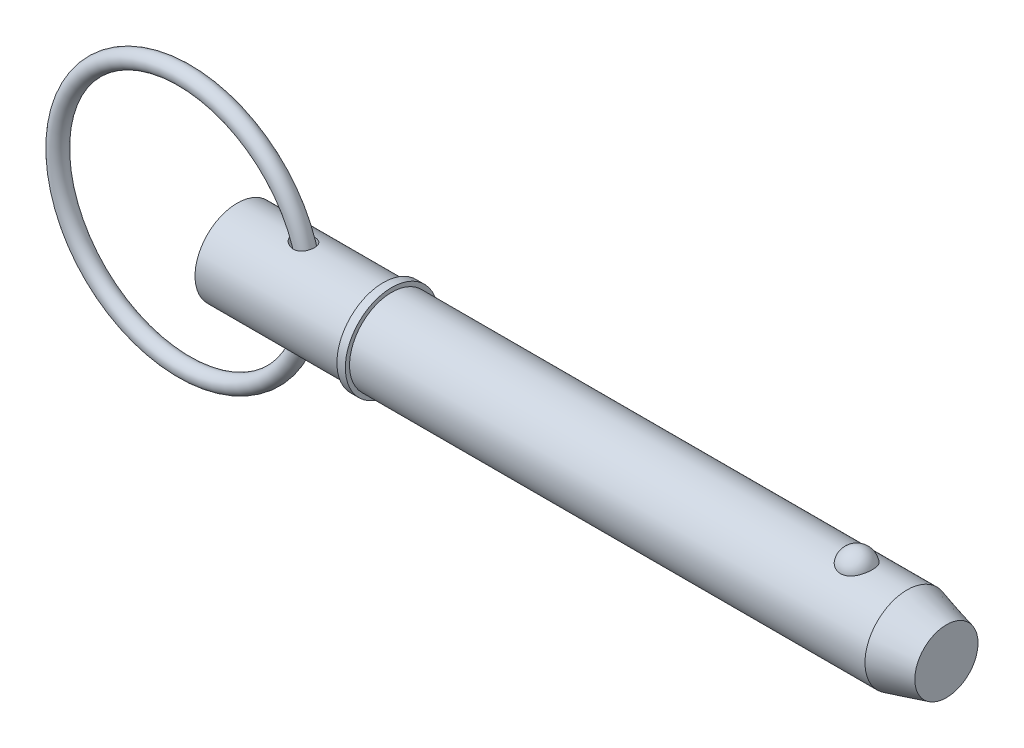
ISO-10303-21;
HEADER;
FILE_DESCRIPTION(('STEP AP214'),'2;1');
FILE_NAME('part.step','',(''),(''),'','','');
FILE_SCHEMA(('AUTOMOTIVE_DESIGN { 1 0 10303 214 1 1 1 1 }'));
ENDSEC;
DATA;
#1=APPLICATION_CONTEXT('core data for automotive mechanical design processes');
#2=APPLICATION_PROTOCOL_DEFINITION('international standard','automotive_design',2000,#1);
#3=PRODUCT_CONTEXT('',#1,'mechanical');
#4=PRODUCT('Part','Part','',(#3));
#5=PRODUCT_RELATED_PRODUCT_CATEGORY('part','',(#4));
#6=PRODUCT_DEFINITION_FORMATION('','',#4);
#7=PRODUCT_DEFINITION_CONTEXT('part definition',#1,'design');
#8=PRODUCT_DEFINITION('design','',#6,#7);
#9=PRODUCT_DEFINITION_SHAPE('','',#8);
#10=(LENGTH_UNIT() NAMED_UNIT(*) SI_UNIT(.MILLI.,.METRE.));
#11=(NAMED_UNIT(*) PLANE_ANGLE_UNIT() SI_UNIT($,.RADIAN.));
#12=(NAMED_UNIT(*) SI_UNIT($,.STERADIAN.) SOLID_ANGLE_UNIT());
#13=UNCERTAINTY_MEASURE_WITH_UNIT(LENGTH_MEASURE(1.E-05),#10,'distance_accuracy_value','');
#14=(GEOMETRIC_REPRESENTATION_CONTEXT(3) GLOBAL_UNCERTAINTY_ASSIGNED_CONTEXT((#13)) GLOBAL_UNIT_ASSIGNED_CONTEXT((#10,
#11,#12)) REPRESENTATION_CONTEXT('',''));
#15=CARTESIAN_POINT('',(0.,0.,0.));
#16=DIRECTION('',(0.,0.,1.));
#17=DIRECTION('',(1.,0.,0.));
#18=AXIS2_PLACEMENT_3D('',#15,#16,#17);
#19=CARTESIAN_POINT('',(-11.9894358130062,0.,0.));
#20=DIRECTION('',(0.,0.,1.));
#21=DIRECTION('',(1.,0.,0.));
#22=AXIS2_PLACEMENT_3D('',#19,#20,#21);
#23=TOROIDAL_SURFACE('',#22,28.575,1.905);
#24=CARTESIAN_POINT('',(18.4905641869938,0.,0.));
#25=VERTEX_POINT('',#24);
#26=VERTEX_LOOP('',#25);
#27=FACE_BOUND('',#26,.T.);
#28=ADVANCED_FACE('P0_F12',(#27),#23,.T.);
#29=CLOSED_SHELL('',(#28));
#30=MANIFOLD_SOLID_BREP('P0_B1',#29);
#31=CARTESIAN_POINT('',(0.,0.,0.));
#32=DIRECTION('',(1.,0.,0.));
#33=DIRECTION('',(0.,0.,-1.));
#34=AXIS2_PLACEMENT_3D('',#31,#32,#33);
#35=CYLINDRICAL_SURFACE('',#34,9.525);
#36=CARTESIAN_POINT('',(12.9513882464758,9.41921920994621,-1.41559473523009));
#37=CARTESIAN_POINT('',(13.0504692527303,9.40163924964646,-1.53256769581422));
#38=CARTESIAN_POINT('',(13.1602600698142,9.38319823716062,-1.64044593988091));
#39=CARTESIAN_POINT('',(13.3966485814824,9.34687220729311,-1.83618480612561));
#40=CARTESIAN_POINT('',(13.5232761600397,9.32898824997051,-1.92400906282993));
#41=CARTESIAN_POINT('',(13.78900694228,9.29593183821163,-2.07784697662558));
#42=CARTESIAN_POINT('',(13.9280753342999,9.28075215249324,-2.14391921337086));
#43=CARTESIAN_POINT('',(14.2153444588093,9.25488828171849,-2.25295850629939));
#44=CARTESIAN_POINT('',(14.3635415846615,9.24420233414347,-2.295934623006));
#45=CARTESIAN_POINT('',(14.669669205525,9.22859713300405,-2.3579005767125));
#46=CARTESIAN_POINT('',(14.8277567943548,9.22385123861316,-2.37617053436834));
#47=CARTESIAN_POINT('',(15.1447573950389,9.22170813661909,-2.38448481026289));
#48=CARTESIAN_POINT('',(15.3036699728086,9.22430739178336,-2.3745427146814));
#49=CARTESIAN_POINT('',(15.6046561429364,9.2363636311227,-2.32717331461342));
#50=CARTESIAN_POINT('',(15.7470893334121,9.24528216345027,-2.29190131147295));
#51=CARTESIAN_POINT('',(16.0228763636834,9.26842607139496,-2.19642882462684));
#52=CARTESIAN_POINT('',(16.1562346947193,9.28264879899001,-2.1362407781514));
#53=CARTESIAN_POINT('',(16.3991522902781,9.31332263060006,-1.99805318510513));
#54=CARTESIAN_POINT('',(16.5097585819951,9.32951023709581,-1.92182839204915));
#55=CARTESIAN_POINT('',(16.7159974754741,9.36298467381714,-1.75147176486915));
#56=CARTESIAN_POINT('',(16.811631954,9.38027136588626,-1.65734217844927));
#57=CARTESIAN_POINT('',(16.9833240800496,9.41356881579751,-1.45618916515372));
#58=CARTESIAN_POINT('',(17.0597719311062,9.42959946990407,-1.34950141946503));
#59=CARTESIAN_POINT('',(17.1939538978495,9.45905380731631,-1.1246201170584));
#60=CARTESIAN_POINT('',(17.2516877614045,9.4724774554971,-1.00642640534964));
#61=CARTESIAN_POINT('',(17.3474400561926,9.49535683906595,-0.760990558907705));
#62=CARTESIAN_POINT('',(17.3853184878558,9.50478431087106,-0.633691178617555));
#63=CARTESIAN_POINT('',(17.4399027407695,9.51852575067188,-0.374363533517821));
#64=CARTESIAN_POINT('',(17.4566077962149,9.52283953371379,-0.242335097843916));
#65=CARTESIAN_POINT('',(17.4685150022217,9.52590431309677,0.0235692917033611));
#66=CARTESIAN_POINT('',(17.4635842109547,9.52462091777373,0.157451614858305));
#67=CARTESIAN_POINT('',(17.4320243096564,9.5165501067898,0.422467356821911));
#68=CARTESIAN_POINT('',(17.4053947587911,9.50976257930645,0.553600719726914));
#69=CARTESIAN_POINT('',(17.3310009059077,9.49140797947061,0.809490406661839));
#70=CARTESIAN_POINT('',(17.2832204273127,9.47983724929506,0.93424176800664));
#71=CARTESIAN_POINT('',(17.1676219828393,9.45318034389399,1.1736825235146));
#72=CARTESIAN_POINT('',(17.0998044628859,9.43809424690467,1.28837214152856));
#73=CARTESIAN_POINT('',(16.9461013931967,9.40614962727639,1.50393386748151));
#74=CARTESIAN_POINT('',(16.8602910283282,9.38929862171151,1.6048606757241));
#75=CARTESIAN_POINT('',(16.6726759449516,9.35566510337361,1.79055313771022));
#76=CARTESIAN_POINT('',(16.5708731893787,9.33888258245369,1.87532077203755));
#77=CARTESIAN_POINT('',(16.3550631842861,9.30741331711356,2.02572386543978));
#78=CARTESIAN_POINT('',(16.2411701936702,9.29270956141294,2.09151983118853));
#79=CARTESIAN_POINT('',(16.0037488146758,9.26681293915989,2.20343355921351));
#80=CARTESIAN_POINT('',(15.8802207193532,9.25561996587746,2.24955191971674));
#81=CARTESIAN_POINT('',(15.6262451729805,9.23779438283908,2.32167613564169));
#82=CARTESIAN_POINT('',(15.4957570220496,9.23119272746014,2.34754561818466));
#83=CARTESIAN_POINT('',(15.2322153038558,9.22318493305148,2.37881082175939));
#84=CARTESIAN_POINT('',(15.0991611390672,9.22178001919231,2.3842017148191));
#85=CARTESIAN_POINT('',(14.8267609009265,9.22414647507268,2.37503099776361));
#86=CARTESIAN_POINT('',(14.6874545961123,9.22819578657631,2.35939810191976));
#87=CARTESIAN_POINT('',(14.412976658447,9.24129253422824,2.30756034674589));
#88=CARTESIAN_POINT('',(14.2778066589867,9.25034191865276,2.27134746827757));
#89=CARTESIAN_POINT('',(14.0027915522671,9.27334688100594,2.17561454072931));
#90=CARTESIAN_POINT('',(13.8635960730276,9.28766658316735,2.11431132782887));
#91=CARTESIAN_POINT('',(13.5969045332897,9.31925368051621,1.97041856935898));
#92=CARTESIAN_POINT('',(13.4694182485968,9.33652350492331,1.88781145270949));
#93=CARTESIAN_POINT('',(13.2243568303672,9.37286659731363,1.69844580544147));
#94=CARTESIAN_POINT('',(13.1075060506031,9.39198626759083,1.5907521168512));
#95=CARTESIAN_POINT('',(12.8957171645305,9.42881110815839,1.35544651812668));
#96=CARTESIAN_POINT('',(12.8007455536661,9.44651841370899,1.22786557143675));
#97=CARTESIAN_POINT('',(12.6580495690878,9.4741137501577,0.98872437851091));
#98=CARTESIAN_POINT('',(12.604453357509,9.4848570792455,0.880756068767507));
#99=CARTESIAN_POINT('',(12.515693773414,9.50295777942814,0.657225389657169));
#100=CARTESIAN_POINT('',(12.4805142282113,9.51031812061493,0.54166978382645));
#101=CARTESIAN_POINT('',(12.4305797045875,9.52083647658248,0.305475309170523));
#102=CARTESIAN_POINT('',(12.4159122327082,9.52397648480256,0.184816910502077));
#103=CARTESIAN_POINT('',(12.408320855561,9.52559626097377,-0.0572308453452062));
#104=CARTESIAN_POINT('',(12.4153963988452,9.52407614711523,-0.178620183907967));
#105=CARTESIAN_POINT('',(12.4495068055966,9.51684301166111,-0.409566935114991));
#106=CARTESIAN_POINT('',(12.4750931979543,9.51143444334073,-0.519353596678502));
#107=CARTESIAN_POINT('',(12.543120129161,9.49733710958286,-0.733285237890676));
#108=CARTESIAN_POINT('',(12.5855568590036,9.4886490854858,-0.837431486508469));
#109=CARTESIAN_POINT('',(12.6780792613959,9.47023833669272,-1.02356028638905));
#110=CARTESIAN_POINT('',(12.7261842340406,9.46084463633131,-1.10657511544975));
#111=CARTESIAN_POINT('',(12.8319313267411,9.44081892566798,-1.26610577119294));
#112=CARTESIAN_POINT('',(12.8895756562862,9.43018662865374,-1.34262008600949));
#113=CARTESIAN_POINT('',(12.9513882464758,9.41921920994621,-1.41559473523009));
#114=B_SPLINE_CURVE_WITH_KNOTS('',3,(#36,#37,#38,#39,#40,#41,#42,#43,#44,#45,#46,#47,#48,#49,
#50,#51,#52,#53,#54,#55,#56,#57,#58,#59,#60,#61,#62,#63,#64,#65,#66,#67,#68,#69,#70,#71,#72,#73,
#74,#75,#76,#77,#78,#79,#80,#81,#82,#83,#84,#85,#86,#87,#88,#89,#90,#91,#92,#93,#94,#95,#96,#97,
#98,#99,#100,#101,#102,#103,#104,#105,#106,#107,#108,#109,#110,#111,#112,#113),.UNSPECIFIED.,
.T.,.F.,(4,2,2,2,2,2,2,2,2,2,2,2,2,2,2,2,2,2,2,2,2,2,2,2,2,2,2,2,2,2,2,2,2,2,2,2,2,2,4),(0.,
0.462524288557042,0.925880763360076,1.3879789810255,1.84989578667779,2.32500103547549,
2.79987752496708,3.23851602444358,3.67693583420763,4.08084875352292,4.48471100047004,
4.87953549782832,5.27436531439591,5.67194282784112,6.0695347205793,6.46957303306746,
6.86961947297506,7.26997240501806,7.67031642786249,8.06901977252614,8.46767421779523,
8.86284969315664,9.25801315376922,9.65581560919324,10.0537118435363,10.4726706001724,
10.8917927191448,11.3481090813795,11.8048030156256,12.2824769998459,12.7594145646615,
13.1209614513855,13.4821903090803,13.8449555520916,14.2077115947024,14.5447865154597,
14.881785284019,15.170268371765,15.4588183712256),.UNSPECIFIED.);
#115=CARTESIAN_POINT('',(12.9513882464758,9.41921920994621,-1.41559473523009));
#116=VERTEX_POINT('',#115);
#117=EDGE_CURVE('P1_E42',#116,#116,#114,.T.);
#118=ORIENTED_EDGE('',*,*,#117,.T.);
#119=EDGE_LOOP('',(#118));
#120=FACE_BOUND('',#119,.T.);
#121=CARTESIAN_POINT('',(0.,0.,0.));
#122=DIRECTION('',(1.,0.,0.));
#123=DIRECTION('',(0.,0.,-1.));
#124=AXIS2_PLACEMENT_3D('',#121,#122,#123);
#125=CIRCLE('',#124,9.525);
#126=CARTESIAN_POINT('',(0.,0.,-9.525));
#127=VERTEX_POINT('',#126);
#128=EDGE_CURVE('P1_E9',#127,#127,#125,.T.);
#129=ORIENTED_EDGE('',*,*,#128,.T.);
#130=EDGE_LOOP('',(#129));
#131=FACE_BOUND('',#130,.T.);
#132=CARTESIAN_POINT('',(33.025,0.,0.));
#133=DIRECTION('',(1.,0.,0.));
#134=DIRECTION('',(0.,0.,-1.));
#135=AXIS2_PLACEMENT_3D('',#132,#133,#134);
#136=CIRCLE('',#135,9.525);
#137=CARTESIAN_POINT('',(33.025,0.,-9.525));
#138=VERTEX_POINT('',#137);
#139=EDGE_CURVE('P1_E25',#138,#138,#136,.T.);
#140=ORIENTED_EDGE('',*,*,#139,.F.);
#141=EDGE_LOOP('',(#140));
#142=FACE_BOUND('',#141,.T.);
#143=CARTESIAN_POINT('',(12.9513882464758,-9.41921920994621,-1.41559473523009));
#144=CARTESIAN_POINT('',(12.8706569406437,-9.43354320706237,-1.32028288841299));
#145=CARTESIAN_POINT('',(12.7970077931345,-9.44729974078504,-1.21890449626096));
#146=CARTESIAN_POINT('',(12.6667099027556,-9.47239055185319,-1.00546491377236));
#147=CARTESIAN_POINT('',(12.6100480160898,-9.48372669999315,-0.893412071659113));
#148=CARTESIAN_POINT('',(12.5163428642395,-9.50281544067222,-0.660202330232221));
#149=CARTESIAN_POINT('',(12.4794216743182,-9.51054569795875,-0.538993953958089));
#150=CARTESIAN_POINT('',(12.4282252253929,-9.52133525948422,-0.29167282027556));
#151=CARTESIAN_POINT('',(12.4139371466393,-9.52439720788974,-0.165562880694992));
#152=CARTESIAN_POINT('',(12.4092595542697,-9.52539668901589,0.0763263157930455));
#153=CARTESIAN_POINT('',(12.4169377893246,-9.5237485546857,0.192070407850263));
#154=CARTESIAN_POINT('',(12.4515961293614,-9.51640070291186,0.420478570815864));
#155=CARTESIAN_POINT('',(12.4785770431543,-9.51070081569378,0.533142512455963));
#156=CARTESIAN_POINT('',(12.5496371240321,-9.49599978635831,0.750537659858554));
#157=CARTESIAN_POINT('',(12.5934215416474,-9.48705569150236,0.855370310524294));
#158=CARTESIAN_POINT('',(12.6960201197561,-9.46670226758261,1.05710432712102));
#159=CARTESIAN_POINT('',(12.754838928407,-9.45529217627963,1.15400322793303));
#160=CARTESIAN_POINT('',(12.8926588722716,-9.42958102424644,1.34883014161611));
#161=CARTESIAN_POINT('',(12.9731843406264,-9.41509922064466,1.44565277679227));
#162=CARTESIAN_POINT('',(13.1473692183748,-9.38554264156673,1.62653953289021));
#163=CARTESIAN_POINT('',(13.2410364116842,-9.37046751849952,1.71059603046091));
#164=CARTESIAN_POINT('',(13.454392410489,-9.33867330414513,1.87697964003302));
#165=CARTESIAN_POINT('',(13.5758667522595,-9.32205896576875,1.95704323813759));
#166=CARTESIAN_POINT('',(13.8299208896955,-9.29140277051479,2.09777392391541));
#167=CARTESIAN_POINT('',(13.9625074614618,-9.27736250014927,2.15842906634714));
#168=CARTESIAN_POINT('',(14.2477938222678,-9.25234849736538,2.26337318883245));
#169=CARTESIAN_POINT('',(14.4012368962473,-9.2417532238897,2.30575283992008));
#170=CARTESIAN_POINT('',(14.7134258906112,-9.22706044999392,2.36387471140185));
#171=CARTESIAN_POINT('',(14.8721705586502,-9.22296142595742,2.37962317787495));
#172=CARTESIAN_POINT('',(15.1841930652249,-9.22219798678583,2.3825815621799));
#173=CARTESIAN_POINT('',(15.3374581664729,-9.22526675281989,2.37081567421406));
#174=CARTESIAN_POINT('',(15.6390558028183,-9.23821642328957,2.31984408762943));
#175=CARTESIAN_POINT('',(15.7873916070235,-9.24809271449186,2.28065697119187));
#176=CARTESIAN_POINT('',(16.0605055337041,-9.27231045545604,2.17997072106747));
#177=CARTESIAN_POINT('',(16.1861988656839,-9.28616347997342,2.12082794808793));
#178=CARTESIAN_POINT('',(16.4248737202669,-9.31689725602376,1.98144352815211));
#179=CARTESIAN_POINT('',(16.5378583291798,-9.33377726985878,1.90120701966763));
#180=CARTESIAN_POINT('',(16.7424913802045,-9.36766057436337,1.72629138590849));
#181=CARTESIAN_POINT('',(16.8349077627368,-9.38461836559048,1.63249912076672));
#182=CARTESIAN_POINT('',(17.0025959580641,-9.41752009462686,1.43052052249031));
#183=CARTESIAN_POINT('',(17.0778684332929,-9.43346407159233,1.32233474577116));
#184=CARTESIAN_POINT('',(17.2093311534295,-9.46256896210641,1.09477833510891));
#185=CARTESIAN_POINT('',(17.2655443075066,-9.47573320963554,0.975421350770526));
#186=CARTESIAN_POINT('',(17.3577240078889,-9.49788660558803,0.72876499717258));
#187=CARTESIAN_POINT('',(17.3936897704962,-9.5068755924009,0.601465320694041));
#188=CARTESIAN_POINT('',(17.4447894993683,-9.51977728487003,0.341392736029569));
#189=CARTESIAN_POINT('',(17.4597470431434,-9.52364698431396,0.208583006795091));
#190=CARTESIAN_POINT('',(17.467935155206,-9.52575588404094,-0.0577507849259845));
#191=CARTESIAN_POINT('',(17.4611651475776,-9.52399493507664,-0.191274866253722));
#192=CARTESIAN_POINT('',(17.4259933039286,-9.51501704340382,-0.455658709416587));
#193=CARTESIAN_POINT('',(17.3975278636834,-9.50778405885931,-0.586509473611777));
#194=CARTESIAN_POINT('',(17.3195245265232,-9.48862442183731,-0.841413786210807));
#195=CARTESIAN_POINT('',(17.2699864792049,-9.47669773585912,-0.965467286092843));
#196=CARTESIAN_POINT('',(17.1510794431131,-9.44947793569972,-1.20302860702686));
#197=CARTESIAN_POINT('',(17.0817421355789,-9.43419020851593,-1.31655289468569));
#198=CARTESIAN_POINT('',(16.9249035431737,-9.40193593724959,-1.52999797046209));
#199=CARTESIAN_POINT('',(16.8374037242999,-9.38496952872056,-1.62991985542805));
#200=CARTESIAN_POINT('',(16.6472525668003,-9.35139745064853,-1.81261591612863));
#201=CARTESIAN_POINT('',(16.544718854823,-9.33479003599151,-1.89551219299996));
#202=CARTESIAN_POINT('',(16.3268885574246,-9.30366076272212,-2.04284430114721));
#203=CARTESIAN_POINT('',(16.2115933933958,-9.28913867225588,-2.10728218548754));
#204=CARTESIAN_POINT('',(15.9721327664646,-9.26380878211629,-2.21598517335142));
#205=CARTESIAN_POINT('',(15.8480095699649,-9.25298455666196,-2.26033977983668));
#206=CARTESIAN_POINT('',(15.5939970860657,-9.23601616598,-2.32870721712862));
#207=CARTESIAN_POINT('',(15.4641070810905,-9.22987258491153,-2.35271750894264));
#208=CARTESIAN_POINT('',(15.1982340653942,-9.22261892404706,-2.38099747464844));
#209=CARTESIAN_POINT('',(15.0621840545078,-9.22166165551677,-2.38466791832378));
#210=CARTESIAN_POINT('',(14.7911713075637,-9.22504733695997,-2.37153091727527));
#211=CARTESIAN_POINT('',(14.6562088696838,-9.22939169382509,-2.35471803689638));
#212=CARTESIAN_POINT('',(14.3799999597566,-9.24325361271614,-2.29972931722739));
#213=CARTESIAN_POINT('',(14.2390842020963,-9.25314817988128,-2.25998976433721));
#214=CARTESIAN_POINT('',(13.9651910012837,-9.2770918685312,-2.15959208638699));
#215=CARTESIAN_POINT('',(13.8322212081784,-9.29114491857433,-2.09891417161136));
#216=CARTESIAN_POINT('',(13.5621642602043,-9.32369066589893,-1.94960068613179));
#217=CARTESIAN_POINT('',(13.4264724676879,-9.34251276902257,-1.85849626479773));
#218=CARTESIAN_POINT('',(13.1736579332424,-9.38095091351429,-1.6535412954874));
#219=CARTESIAN_POINT('',(13.0565182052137,-9.40056620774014,-1.53971177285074));
#220=CARTESIAN_POINT('',(12.9513882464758,-9.41921920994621,-1.41559473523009));
#221=B_SPLINE_CURVE_WITH_KNOTS('',3,(#143,#144,#145,#146,#147,#148,#149,#150,#151,#152,#153,
#154,#155,#156,#157,#158,#159,#160,#161,#162,#163,#164,#165,#166,#167,#168,#169,#170,#171,#172,
#173,#174,#175,#176,#177,#178,#179,#180,#181,#182,#183,#184,#185,#186,#187,#188,#189,#190,#191,
#192,#193,#194,#195,#196,#197,#198,#199,#200,#201,#202,#203,#204,#205,#206,#207,#208,#209,#210,
#211,#212,#213,#214,#215,#216,#217,#218,#219,#220),.UNSPECIFIED.,.T.,.F.,(4,2,2,2,2,2,2,2,2,2,2,
2,2,2,2,2,2,2,2,2,2,2,2,2,2,2,2,2,2,2,2,2,2,2,2,2,2,2,4),(0.,0.37674646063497,0.753200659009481,
1.13195666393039,1.51049805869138,1.85679105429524,2.20309856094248,2.54359033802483,
2.88418751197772,3.26301611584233,3.64207005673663,4.07954912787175,4.51729693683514,
4.99355673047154,5.46970480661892,5.92841231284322,6.38680927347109,6.80346940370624,
7.2200281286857,7.61642768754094,8.01281192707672,8.4087180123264,8.8046394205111,
9.20386620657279,9.60310357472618,10.0035159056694,10.4039310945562,10.8037091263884,
11.2034549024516,11.6002252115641,11.9969513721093,12.3918916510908,12.7868812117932,
13.1934480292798,13.6001227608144,14.038511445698,14.4773156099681,14.9683748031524,
15.4589817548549),.UNSPECIFIED.);
#222=CARTESIAN_POINT('',(12.9513882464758,-9.41921920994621,-1.41559473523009));
#223=VERTEX_POINT('',#222);
#224=EDGE_CURVE('P1_E17',#223,#223,#221,.T.);
#225=ORIENTED_EDGE('',*,*,#224,.T.);
#226=EDGE_LOOP('',(#225));
#227=FACE_BOUND('',#226,.T.);
#228=ADVANCED_FACE('P1_F13',(#120,#131,#142,#227),#35,.T.);
#229=CARTESIAN_POINT('',(0.,0.,0.));
#230=DIRECTION('',(1.,0.,0.));
#231=DIRECTION('',(0.,0.,-1.));
#232=AXIS2_PLACEMENT_3D('',#229,#230,#231);
#233=CYLINDRICAL_SURFACE('',#232,9.525);
#234=CARTESIAN_POINT('',(151.443054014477,0.,0.));
#235=DIRECTION('',(1.,0.,0.));
#236=DIRECTION('',(0.,0.,-1.));
#237=AXIS2_PLACEMENT_3D('',#234,#235,#236);
#238=CIRCLE('',#237,9.525);
#239=CARTESIAN_POINT('',(151.443054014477,0.,-9.525));
#240=VERTEX_POINT('',#239);
#241=EDGE_CURVE('P1_E99',#240,#240,#238,.T.);
#242=ORIENTED_EDGE('',*,*,#241,.F.);
#243=EDGE_LOOP('',(#242));
#244=FACE_BOUND('',#243,.T.);
#245=CARTESIAN_POINT('',(34.93,0.,0.));
#246=DIRECTION('',(1.,0.,0.));
#247=DIRECTION('',(0.,0.,-1.));
#248=AXIS2_PLACEMENT_3D('',#245,#246,#247);
#249=CIRCLE('',#248,9.525);
#250=CARTESIAN_POINT('',(34.93,0.,-9.525));
#251=VERTEX_POINT('',#250);
#252=EDGE_CURVE('P1_E96',#251,#251,#249,.T.);
#253=ORIENTED_EDGE('',*,*,#252,.T.);
#254=EDGE_LOOP('',(#253));
#255=FACE_BOUND('',#254,.T.);
#256=CARTESIAN_POINT('',(140.045757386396,8.80405803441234,3.63513233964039));
#257=CARTESIAN_POINT('',(139.951676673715,8.80405953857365,3.63513053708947));
#258=CARTESIAN_POINT('',(139.857561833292,8.80561325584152,3.63137461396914));
#259=CARTESIAN_POINT('',(139.670012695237,8.81177748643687,3.61638665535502));
#260=CARTESIAN_POINT('',(139.576578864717,8.81638992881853,3.60514990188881));
#261=CARTESIAN_POINT('',(139.297945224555,8.83467114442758,3.56024627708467));
#262=CARTESIAN_POINT('',(139.114691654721,8.85278327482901,3.51538626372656));
#263=CARTESIAN_POINT('',(138.759509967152,8.89871214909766,3.39742145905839));
#264=CARTESIAN_POINT('',(138.587553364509,8.9265032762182,3.32439116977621));
#265=CARTESIAN_POINT('',(138.258707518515,8.98874819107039,3.15220244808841));
#266=CARTESIAN_POINT('',(138.101811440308,9.02319893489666,3.053055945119));
#267=CARTESIAN_POINT('',(137.802214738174,9.0962918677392,2.82797815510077));
#268=CARTESIAN_POINT('',(137.660060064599,9.13502685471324,2.7013513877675));
#269=CARTESIAN_POINT('',(137.398299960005,9.21186572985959,2.4264193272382));
#270=CARTESIAN_POINT('',(137.278701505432,9.2499694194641,2.27810735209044));
#271=CARTESIAN_POINT('',(137.059645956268,9.3234108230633,1.95652290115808));
#272=CARTESIAN_POINT('',(136.961317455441,9.35855090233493,1.78243511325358));
#273=CARTESIAN_POINT('',(136.793819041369,9.42045142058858,1.41937246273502));
#274=CARTESIAN_POINT('',(136.724651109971,9.44721128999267,1.23039658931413));
#275=CARTESIAN_POINT('',(136.616199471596,9.48990641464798,0.840370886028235));
#276=CARTESIAN_POINT('',(136.577288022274,9.50570658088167,0.639202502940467));
#277=CARTESIAN_POINT('',(136.531555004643,9.52433146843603,0.232664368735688));
#278=CARTESIAN_POINT('',(136.524732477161,9.52715657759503,0.0272947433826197));
#279=CARTESIAN_POINT('',(136.543255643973,9.51956918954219,-0.380478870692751));
#280=CARTESIAN_POINT('',(136.568405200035,9.50923740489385,-0.582893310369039));
#281=CARTESIAN_POINT('',(136.65002537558,9.47651897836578,-0.98029399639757));
#282=CARTESIAN_POINT('',(136.706496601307,9.45413210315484,-1.17528009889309));
#283=CARTESIAN_POINT('',(136.849719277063,9.39954044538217,-1.55263697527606));
#284=CARTESIAN_POINT('',(136.936512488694,9.36732213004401,-1.73498993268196));
#285=CARTESIAN_POINT('',(137.138610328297,9.29640700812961,-2.0817776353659));
#286=CARTESIAN_POINT('',(137.253917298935,9.25770966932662,-2.24621090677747));
#287=CARTESIAN_POINT('',(137.511264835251,9.17775604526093,-2.55338333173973));
#288=CARTESIAN_POINT('',(137.653434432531,9.13648808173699,-2.69601150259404));
#289=CARTESIAN_POINT('',(137.96089985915,9.05620497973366,-2.95451229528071));
#290=CARTESIAN_POINT('',(138.126193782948,9.01718965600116,-3.07038711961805));
#291=CARTESIAN_POINT('',(138.472052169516,8.94680019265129,-3.26976836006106));
#292=CARTESIAN_POINT('',(138.652227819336,8.91528408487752,-3.35389750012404));
#293=CARTESIAN_POINT('',(139.025651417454,8.86272514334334,-3.49043503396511));
#294=CARTESIAN_POINT('',(139.218894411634,8.84167836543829,-3.54285537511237));
#295=CARTESIAN_POINT('',(139.602503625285,8.81348056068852,-3.612413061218));
#296=CARTESIAN_POINT('',(139.792525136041,8.80568348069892,-3.63119339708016));
#297=CARTESIAN_POINT('',(140.173190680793,8.80289410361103,-3.63795342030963));
#298=CARTESIAN_POINT('',(140.363834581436,8.80789922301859,-3.62593932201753));
#299=CARTESIAN_POINT('',(140.734007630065,8.82974915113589,-3.57238430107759));
#300=CARTESIAN_POINT('',(140.913697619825,8.84621463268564,-3.53178890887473));
#301=CARTESIAN_POINT('',(141.263422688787,8.88875330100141,-3.42331083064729));
#302=CARTESIAN_POINT('',(141.433456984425,8.91482726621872,-3.35542593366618));
#303=CARTESIAN_POINT('',(141.763237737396,8.974482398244,-3.1924822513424));
#304=CARTESIAN_POINT('',(141.922680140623,9.00821446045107,-3.09686474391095));
#305=CARTESIAN_POINT('',(142.223513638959,9.0793539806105,-2.88162736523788));
#306=CARTESIAN_POINT('',(142.364900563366,9.1167622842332,-2.7620019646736));
#307=CARTESIAN_POINT('',(142.63331931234,9.19347419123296,-2.4951628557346));
#308=CARTESIAN_POINT('',(142.759275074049,9.23277872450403,-2.3468661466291));
#309=CARTESIAN_POINT('',(142.985522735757,9.30737610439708,-2.03093683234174));
#310=CARTESIAN_POINT('',(143.08581004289,9.34266823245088,-1.86330077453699));
#311=CARTESIAN_POINT('',(143.261514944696,9.40674710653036,-1.50744893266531));
#312=CARTESIAN_POINT('',(143.336041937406,9.4352917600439,-1.31874876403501));
#313=CARTESIAN_POINT('',(143.45416505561,9.4814413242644,-0.930631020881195));
#314=CARTESIAN_POINT('',(143.497760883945,9.49904612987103,-0.731213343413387));
#315=CARTESIAN_POINT('',(143.553158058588,9.5215314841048,-0.327147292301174));
#316=CARTESIAN_POINT('',(143.564935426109,9.52640243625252,-0.122495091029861));
#317=CARTESIAN_POINT('',(143.556382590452,9.52289571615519,0.286018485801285));
#318=CARTESIAN_POINT('',(143.53605305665,9.51451832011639,0.489879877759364));
#319=CARTESIAN_POINT('',(143.463884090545,9.48544083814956,0.889994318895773));
#320=CARTESIAN_POINT('',(143.412199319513,9.46480124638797,1.08627971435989));
#321=CARTESIAN_POINT('',(143.278491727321,9.41333895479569,1.46682086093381));
#322=CARTESIAN_POINT('',(143.196466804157,9.38251554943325,1.65107577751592));
#323=CARTESIAN_POINT('',(143.00319292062,9.31365636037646,2.00346348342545));
#324=CARTESIAN_POINT('',(142.891783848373,9.27558138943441,2.17150083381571));
#325=CARTESIAN_POINT('',(142.642294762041,9.19638714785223,2.48563115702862));
#326=CARTESIAN_POINT('',(142.504216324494,9.1552680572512,2.63172542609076));
#327=CARTESIAN_POINT('',(142.204843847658,9.07465393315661,2.89750997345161));
#328=CARTESIAN_POINT('',(142.043610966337,9.03515496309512,3.01726776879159));
#329=CARTESIAN_POINT('',(141.701613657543,8.96227564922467,3.22732920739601));
#330=CARTESIAN_POINT('',(141.520841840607,8.92889763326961,3.3176216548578));
#331=CARTESIAN_POINT('',(141.151445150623,8.87345380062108,3.4631441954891));
#332=CARTESIAN_POINT('',(140.96332371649,8.85102983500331,3.51950082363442));
#333=CARTESIAN_POINT('',(140.67578699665,8.82666967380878,3.57993683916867));
#334=CARTESIAN_POINT('',(140.579133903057,8.82009725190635,3.59606217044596));
#335=CARTESIAN_POINT('',(140.384677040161,8.81020897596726,3.62022512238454));
#336=CARTESIAN_POINT('',(140.28687410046,8.80689090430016,3.62826825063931));
#337=CARTESIAN_POINT('',(140.141224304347,8.80445615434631,3.63416760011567));
#338=CARTESIAN_POINT('',(140.093495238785,8.80405727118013,3.63513325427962));
#339=CARTESIAN_POINT('',(140.045757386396,8.80405803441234,3.63513233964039));
#340=B_SPLINE_CURVE_WITH_KNOTS('',3,(#256,#257,#258,#259,#260,#261,#262,#263,#264,#265,#266,
#267,#268,#269,#270,#271,#272,#273,#274,#275,#276,#277,#278,#279,#280,#281,#282,#283,#284,#285,
#286,#287,#288,#289,#290,#291,#292,#293,#294,#295,#296,#297,#298,#299,#300,#301,#302,#303,#304,
#305,#306,#307,#308,#309,#310,#311,#312,#313,#314,#315,#316,#317,#318,#319,#320,#321,#322,#323,
#324,#325,#326,#327,#328,#329,#330,#331,#332,#333,#334,#335,#336,#337,#338,#339),.UNSPECIFIED.,
.T.,.F.,(4,2,2,2,2,2,2,2,2,2,2,2,2,2,2,2,2,2,2,2,2,2,2,2,2,2,2,2,2,2,2,2,2,2,2,2,2,2,2,2,2,4),
(0.,0.282202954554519,0.564584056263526,1.13017050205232,1.69427128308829,2.25811483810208,
2.83836627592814,3.41879688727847,4.02497117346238,4.63118665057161,5.2447475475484,
5.85829010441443,6.46808687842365,7.0778954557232,7.68854723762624,8.29924920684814,
8.91296283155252,9.52662591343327,10.127533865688,10.7282152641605,11.2986646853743,
11.8689989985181,12.4213015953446,12.9736489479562,13.5380053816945,14.102491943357,
14.6952986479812,15.288211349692,15.8999469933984,16.5116885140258,17.1238909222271,
17.7360805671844,18.3452748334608,18.954511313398,19.5671386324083,20.1797297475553,
20.7907316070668,21.4019653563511,21.9915938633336,22.2859053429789,22.5800161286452,
22.7232098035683),.UNSPECIFIED.);
#341=CARTESIAN_POINT('',(140.045757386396,8.80405803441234,3.63513233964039));
#342=VERTEX_POINT('',#341);
#343=EDGE_CURVE('P1_E34',#342,#342,#340,.T.);
#344=ORIENTED_EDGE('',*,*,#343,.T.);
#345=EDGE_LOOP('',(#344));
#346=FACE_BOUND('',#345,.T.);
#347=ADVANCED_FACE('P1_F46',(#244,#255,#346),#233,.T.);
#348=CARTESIAN_POINT('',(0.,0.,0.));
#349=DIRECTION('',(-1.,0.,0.));
#350=DIRECTION('',(0.,0.,1.));
#351=AXIS2_PLACEMENT_3D('',#348,#349,#350);
#352=PLANE('',#351);
#353=ORIENTED_EDGE('',*,*,#128,.F.);
#354=EDGE_LOOP('',(#353));
#355=FACE_BOUND('',#354,.T.);
#356=ADVANCED_FACE('P1_F15',(#355),#352,.T.);
#357=CARTESIAN_POINT('',(33.025,9.525,0.));
#358=DIRECTION('',(-1.,0.,0.));
#359=DIRECTION('',(0.,0.,1.));
#360=AXIS2_PLACEMENT_3D('',#357,#358,#359);
#361=PLANE('',#360);
#362=ORIENTED_EDGE('',*,*,#139,.T.);
#363=EDGE_LOOP('',(#362));
#364=FACE_BOUND('',#363,.T.);
#365=CARTESIAN_POINT('',(33.025,0.,0.));
#366=DIRECTION('',(1.,0.,0.));
#367=DIRECTION('',(0.,0.,-1.));
#368=AXIS2_PLACEMENT_3D('',#365,#366,#367);
#369=CIRCLE('',#368,10.4775);
#370=CARTESIAN_POINT('',(33.025,0.,-10.4775));
#371=VERTEX_POINT('',#370);
#372=EDGE_CURVE('P1_E30',#371,#371,#369,.T.);
#373=ORIENTED_EDGE('',*,*,#372,.F.);
#374=EDGE_LOOP('',(#373));
#375=FACE_BOUND('',#374,.T.);
#376=ADVANCED_FACE('P1_F81',(#364,#375),#361,.T.);
#377=CARTESIAN_POINT('',(0.,0.,0.));
#378=DIRECTION('',(1.,0.,0.));
#379=DIRECTION('',(0.,0.,-1.));
#380=AXIS2_PLACEMENT_3D('',#377,#378,#379);
#381=CYLINDRICAL_SURFACE('',#380,10.4775);
#382=ORIENTED_EDGE('',*,*,#372,.T.);
#383=EDGE_LOOP('',(#382));
#384=FACE_BOUND('',#383,.T.);
#385=CARTESIAN_POINT('',(34.93,0.,0.));
#386=DIRECTION('',(1.,0.,0.));
#387=DIRECTION('',(0.,0.,-1.));
#388=AXIS2_PLACEMENT_3D('',#385,#386,#387);
#389=CIRCLE('',#388,10.4775);
#390=CARTESIAN_POINT('',(34.93,0.,-10.4775));
#391=VERTEX_POINT('',#390);
#392=EDGE_CURVE('P1_E95',#391,#391,#389,.T.);
#393=ORIENTED_EDGE('',*,*,#392,.F.);
#394=EDGE_LOOP('',(#393));
#395=FACE_BOUND('',#394,.T.);
#396=ADVANCED_FACE('P1_F68',(#384,#395),#381,.T.);
#397=CARTESIAN_POINT('',(34.93,10.4775,0.));
#398=DIRECTION('',(1.,0.,0.));
#399=DIRECTION('',(0.,0.,-1.));
#400=AXIS2_PLACEMENT_3D('',#397,#398,#399);
#401=PLANE('',#400);
#402=ORIENTED_EDGE('',*,*,#392,.T.);
#403=EDGE_LOOP('',(#402));
#404=FACE_BOUND('',#403,.T.);
#405=ORIENTED_EDGE('',*,*,#252,.F.);
#406=EDGE_LOOP('',(#405));
#407=FACE_BOUND('',#406,.T.);
#408=ADVANCED_FACE('P1_F62',(#404,#407),#401,.T.);
#409=CARTESIAN_POINT('',(160.33,0.,0.));
#410=DIRECTION('',(-1.,0.,0.));
#411=DIRECTION('',(0.,0.,1.));
#412=AXIS2_PLACEMENT_3D('',#409,#410,#411);
#413=CONICAL_SURFACE('',#412,7.14375000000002,0.261799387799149);
#414=ORIENTED_EDGE('',*,*,#241,.T.);
#415=EDGE_LOOP('',(#414));
#416=FACE_BOUND('',#415,.T.);
#417=CARTESIAN_POINT('',(160.33,0.,0.));
#418=DIRECTION('',(1.,0.,0.));
#419=DIRECTION('',(0.,0.,-1.));
#420=AXIS2_PLACEMENT_3D('',#417,#418,#419);
#421=CIRCLE('',#420,7.14375000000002);
#422=CARTESIAN_POINT('',(160.33,0.,-7.14375000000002));
#423=VERTEX_POINT('',#422);
#424=EDGE_CURVE('P1_E41',#423,#423,#421,.T.);
#425=ORIENTED_EDGE('',*,*,#424,.F.);
#426=EDGE_LOOP('',(#425));
#427=FACE_BOUND('',#426,.T.);
#428=ADVANCED_FACE('P1_F59',(#416,#427),#413,.T.);
#429=CARTESIAN_POINT('',(160.33,7.14375000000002,0.));
#430=DIRECTION('',(1.,0.,0.));
#431=DIRECTION('',(0.,0.,-1.));
#432=AXIS2_PLACEMENT_3D('',#429,#430,#431);
#433=PLANE('',#432);
#434=ORIENTED_EDGE('',*,*,#424,.T.);
#435=EDGE_LOOP('',(#434));
#436=FACE_BOUND('',#435,.T.);
#437=ADVANCED_FACE('P1_F55',(#436),#433,.T.);
#438=CARTESIAN_POINT('',(140.045757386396,8.57249999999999,0.));
#439=DIRECTION('',(-1.,0.,0.));
#440=DIRECTION('',(0.,1.,0.));
#441=AXIS2_PLACEMENT_3D('',#438,#439,#440);
#442=SPHERICAL_SURFACE('',#441,3.64250000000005);
#443=ORIENTED_EDGE('',*,*,#343,.F.);
#444=EDGE_LOOP('',(#443));
#445=FACE_BOUND('',#444,.T.);
#446=ADVANCED_FACE('P1_F50',(#445),#442,.T.);
#447=CARTESIAN_POINT('',(-11.9894358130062,0.,0.));
#448=DIRECTION('',(0.,0.,1.));
#449=DIRECTION('',(1.,0.,0.));
#450=AXIS2_PLACEMENT_3D('',#447,#448,#449);
#451=TOROIDAL_SURFACE('',#450,28.575,2.38125);
#452=ORIENTED_EDGE('',*,*,#224,.F.);
#453=EDGE_LOOP('',(#452));
#454=FACE_BOUND('',#453,.T.);
#455=ORIENTED_EDGE('',*,*,#117,.F.);
#456=EDGE_LOOP('',(#455));
#457=FACE_BOUND('',#456,.T.);
#458=ADVANCED_FACE('P1_F54',(#454,#457),#451,.F.);
#459=CLOSED_SHELL('',(#228,#347,#356,#376,#396,#408,#428,#437,#446,#458));
#460=MANIFOLD_SOLID_BREP('P1_B1',#459);
#461=ADVANCED_BREP_SHAPE_REPRESENTATION('',(#18,#30,#460),#14);
#462=SHAPE_DEFINITION_REPRESENTATION(#9,#461);
ENDSEC;
END-ISO-10303-21;
